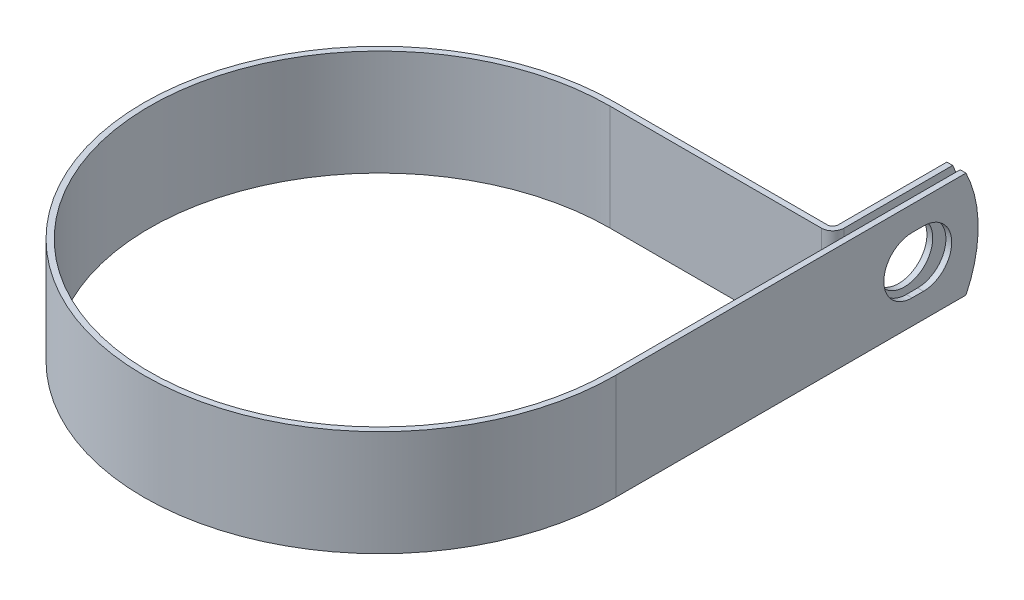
from build123d import *

# Parameters (mm, degrees)
EXTRUDE_THIN1_DEPTH = 11.1125
SKETCH2_R           = 5.9436
CUT_EXTRUDE1_DEPTH  = 1.2192
CUT_EXTRUDE2_REACH  = 127.631
CUT_EXTRUDE3_DEPTH  = 123.484652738


with BuildPart() as part:
    # Sketch1 → Extrude-Thin1 (new, symmetric)
    with BuildSketch(Plane(origin=(0, 0, 0), x_dir=(1, 0, 0), z_dir=(0, 1, 0))):
        with BuildLine():
            Line((48.4124, 76.2), (48.4124, 48.4124))
            Line((48.4124, 48.4124), (48.4124, 0))
            ThreePointArc((48.4124, 0), (-34.232736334, -34.232736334), (0, 48.4124))
            Line((0, 48.4124), (44.46016, 48.4124))
            ThreePointArc((44.46016, 48.4124), (46.141263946, 49.108736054), (46.8376, 50.78984))
            Line((46.8376, 50.78984), (46.8376, 76.2))
            Line((46.8376, 76.2), (45.6184, 76.2))
            Line((45.6184, 76.2), (45.6184, 50.78984))
            ThreePointArc((45.6184, 50.78984), (45.279159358, 49.970840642), (44.46016, 49.6316))
            Line((44.46016, 49.6316), (0, 49.6316))
            ThreePointArc((0, 49.6316), (-35.094840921, -35.094840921), (49.6316, 0))
            Line((49.6316, 0), (49.6316, 48.4124))
            Line((49.6316, 48.4124), (49.6316, 76.2))
            Line((49.6316, 76.2), (48.4124, 76.2))
        make_face()
    extrude(amount=EXTRUDE_THIN1_DEPTH, both=True)

    # Sketch2 → Cut-Extrude1 (cut)
    with BuildSketch(Plane.ZY.offset(-45.6184)):
        with Locations((-63.5, 0)):
            Circle(SKETCH2_R)
    extrude(amount=-CUT_EXTRUDE1_DEPTH, mode=Mode.SUBTRACT)

    # Sketch3 → Cut-Extrude2 (cut, up to next)
    with BuildSketch(Plane(origin=(49.6316, 0, 0), x_dir=(0, 0, -1), z_dir=(1, 0, 0)), mode=Mode.PRIVATE) as cut_extrude2_sk1:
        with BuildLine():
            Line((62.3062, 5.9436), (64.6938, 5.9436))
            ThreePointArc((64.6938, 5.9436), (70.6374, 0), (64.6938, -5.9436))
            Line((64.6938, -5.9436), (62.3062, -5.9436))
            ThreePointArc((62.3062, -5.9436), (56.3626, 0), (62.3062, 5.9436))
        make_face()
    cut_extrude2_tool1 = extrude(cut_extrude2_sk1.sketch, amount=-CUT_EXTRUDE2_REACH, mode=Mode.PRIVATE) & part.part
    add(cut_extrude2_tool1.solids().sort_by_distance((49.6316, 0, -63.5))[0], mode=Mode.SUBTRACT)

    # Sketch4 → Cut-Extrude3 (cut, through all)
    with BuildSketch(Plane.ZY.offset(-45.6184)):
        with BuildLine():
            Line((-73.64014763, 11.1125), (-76.2, 11.1125))
            Line((-76.2, 11.1125), (-76.2, 0))
            ThreePointArc((-76.2, 0), (-75.551765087, 5.701765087), (-73.64014763, 11.1125))
        make_face()
        with BuildLine():
            ThreePointArc((-73.64014763, -11.1125), (-75.551765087, -5.701765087), (-76.2, 0))
            Line((-76.2, 0), (-76.2, -11.1125))
            Line((-76.2, -11.1125), (-73.64014763, -11.1125))
        make_face()
    extrude(amount=-CUT_EXTRUDE3_DEPTH, mode=Mode.SUBTRACT)


solid = part.part
